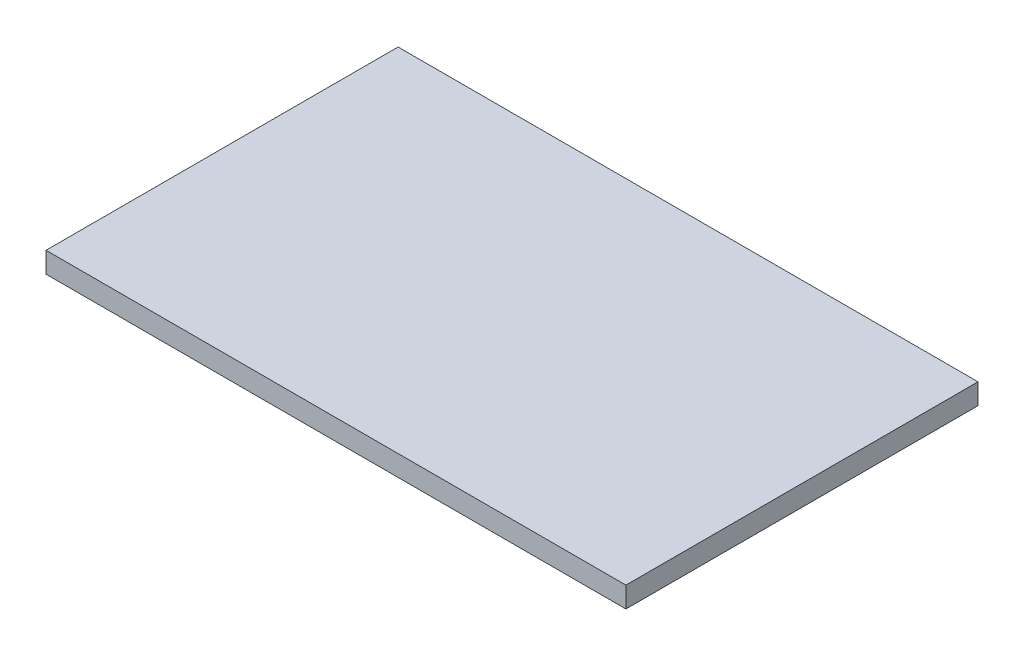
from build123d import *

# Parameters (mm, degrees)
ESQUISSE1_W      = 14
ESQUISSE1_H      = 8.5
EXTRUSION1_DEPTH = 0.5


with BuildPart() as part:
    # Esquisse1 → Extrusion1 (new body)
    with BuildSketch(Plane(origin=(0, 0, 0), x_dir=(1, 0, 0), z_dir=(0, 1, 0))):
        with Locations((7, -4.25)):
            Rectangle(ESQUISSE1_W, ESQUISSE1_H)
    extrude(amount=EXTRUSION1_DEPTH)


solid = part.part
